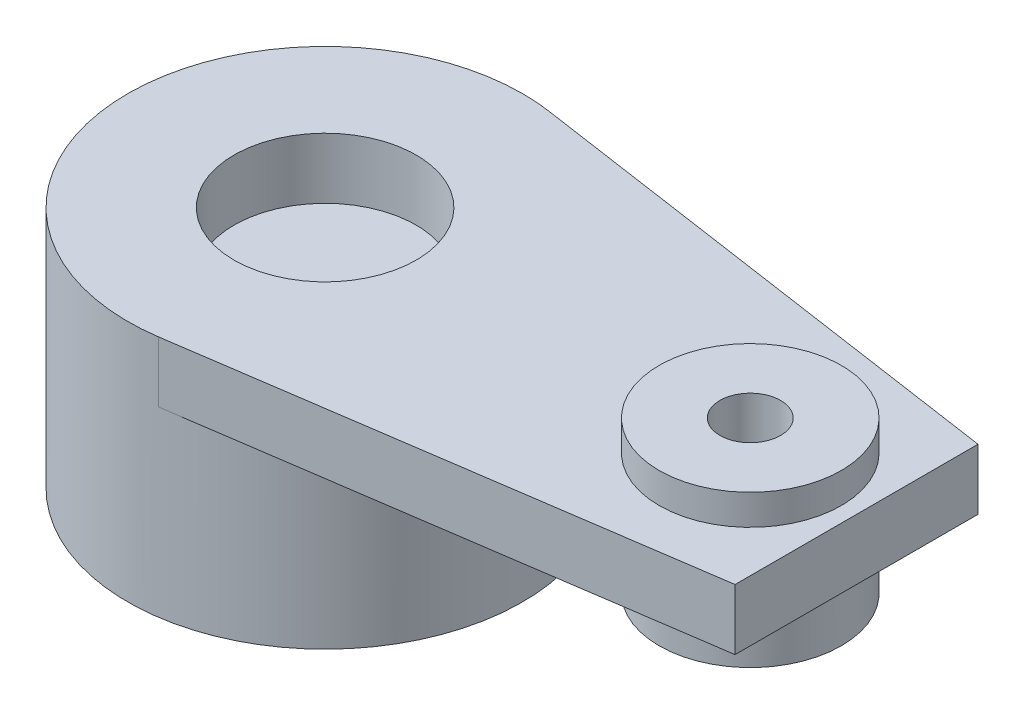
ISO-10303-21;
HEADER;
FILE_DESCRIPTION(('STEP AP214'),'2;1');
FILE_NAME('part.step','',(''),(''),'','','');
FILE_SCHEMA(('AUTOMOTIVE_DESIGN { 1 0 10303 214 1 1 1 1 }'));
ENDSEC;
DATA;
#1=APPLICATION_CONTEXT('core data for automotive mechanical design processes');
#2=APPLICATION_PROTOCOL_DEFINITION('international standard','automotive_design',2000,#1);
#3=PRODUCT_CONTEXT('',#1,'mechanical');
#4=PRODUCT('Part','Part','',(#3));
#5=PRODUCT_RELATED_PRODUCT_CATEGORY('part','',(#4));
#6=PRODUCT_DEFINITION_FORMATION('','',#4);
#7=PRODUCT_DEFINITION_CONTEXT('part definition',#1,'design');
#8=PRODUCT_DEFINITION('design','',#6,#7);
#9=PRODUCT_DEFINITION_SHAPE('','',#8);
#10=(LENGTH_UNIT() NAMED_UNIT(*) SI_UNIT(.MILLI.,.METRE.));
#11=(NAMED_UNIT(*) PLANE_ANGLE_UNIT() SI_UNIT($,.RADIAN.));
#12=(NAMED_UNIT(*) SI_UNIT($,.STERADIAN.) SOLID_ANGLE_UNIT());
#13=UNCERTAINTY_MEASURE_WITH_UNIT(LENGTH_MEASURE(1.E-05),#10,'distance_accuracy_value','');
#14=(GEOMETRIC_REPRESENTATION_CONTEXT(3) GLOBAL_UNCERTAINTY_ASSIGNED_CONTEXT((#13)) GLOBAL_UNIT_ASSIGNED_CONTEXT((#10,
#11,#12)) REPRESENTATION_CONTEXT('',''));
#15=CARTESIAN_POINT('',(0.,0.,0.));
#16=DIRECTION('',(0.,0.,1.));
#17=DIRECTION('',(1.,0.,0.));
#18=AXIS2_PLACEMENT_3D('',#15,#16,#17);
#19=CARTESIAN_POINT('',(0.,2.54,0.));
#20=DIRECTION('',(0.,1.,0.));
#21=DIRECTION('',(0.,0.,1.));
#22=AXIS2_PLACEMENT_3D('',#19,#20,#21);
#23=PLANE('',#22);
#24=DIRECTION('',(-0.989390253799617,0.,0.145282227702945));
#25=VECTOR('',#24,1.);
#26=CARTESIAN_POINT('',(1.19930478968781,2.54,8.16741654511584));
#27=LINE('',#26,#25);
#28=CARTESIAN_POINT('',(22.225,2.54,5.08));
#29=VERTEX_POINT('',#28);
#30=CARTESIAN_POINT('',(1.19930478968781,2.54,8.16741654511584));
#31=VERTEX_POINT('',#30);
#32=EDGE_CURVE('E108',#29,#31,#27,.T.);
#33=ORIENTED_EDGE('',*,*,#32,.F.);
#34=DIRECTION('',(0.,0.,1.));
#35=VECTOR('',#34,1.);
#36=CARTESIAN_POINT('',(22.225,2.54,0.));
#37=LINE('',#36,#35);
#38=CARTESIAN_POINT('',(22.225,2.54,-5.08));
#39=VERTEX_POINT('',#38);
#40=EDGE_CURVE('E125',#39,#29,#37,.T.);
#41=ORIENTED_EDGE('',*,*,#40,.F.);
#42=DIRECTION('',(-0.989390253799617,0.,-0.145282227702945));
#43=VECTOR('',#42,1.);
#44=CARTESIAN_POINT('',(1.19930478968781,2.54,-8.16741654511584));
#45=LINE('',#44,#43);
#46=CARTESIAN_POINT('',(1.19930478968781,2.54,-8.16741654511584));
#47=VERTEX_POINT('',#46);
#48=EDGE_CURVE('E134',#39,#47,#45,.T.);
#49=ORIENTED_EDGE('',*,*,#48,.T.);
#50=CARTESIAN_POINT('',(0.,2.54,0.));
#51=DIRECTION('',(0.,1.,0.));
#52=DIRECTION('',(0.,0.,1.));
#53=AXIS2_PLACEMENT_3D('',#50,#51,#52);
#54=CIRCLE('',#53,8.255);
#55=EDGE_CURVE('E62',#47,#31,#54,.T.);
#56=ORIENTED_EDGE('',*,*,#55,.T.);
#57=EDGE_LOOP('',(#33,#41,#49,#56));
#58=FACE_BOUND('',#57,.T.);
#59=CARTESIAN_POINT('',(0.,2.54,0.));
#60=DIRECTION('',(0.,1.,0.));
#61=DIRECTION('',(0.,0.,1.));
#62=AXIS2_PLACEMENT_3D('',#59,#60,#61);
#63=CIRCLE('',#62,3.81);
#64=CARTESIAN_POINT('',(0.,2.54,3.81));
#65=VERTEX_POINT('',#64);
#66=EDGE_CURVE('E141',#65,#65,#63,.T.);
#67=ORIENTED_EDGE('',*,*,#66,.F.);
#68=EDGE_LOOP('',(#67));
#69=FACE_BOUND('',#68,.T.);
#70=CARTESIAN_POINT('',(17.78,2.54,0.));
#71=DIRECTION('',(0.,1.,0.));
#72=DIRECTION('',(0.,0.,1.));
#73=AXIS2_PLACEMENT_3D('',#70,#71,#72);
#74=CIRCLE('',#73,3.81);
#75=CARTESIAN_POINT('',(17.78,2.54,3.81));
#76=VERTEX_POINT('',#75);
#77=EDGE_CURVE('E159',#76,#76,#74,.T.);
#78=ORIENTED_EDGE('',*,*,#77,.F.);
#79=EDGE_LOOP('',(#78));
#80=FACE_BOUND('',#79,.T.);
#81=ADVANCED_FACE('F44',(#58,#69,#80),#23,.T.);
#82=CARTESIAN_POINT('',(0.,0.,0.));
#83=DIRECTION('',(0.,1.,0.));
#84=DIRECTION('',(0.,0.,1.));
#85=AXIS2_PLACEMENT_3D('',#82,#83,#84);
#86=PLANE('',#85);
#87=CARTESIAN_POINT('',(0.,0.,0.));
#88=DIRECTION('',(0.,-1.,0.));
#89=DIRECTION('',(0.,0.,-1.));
#90=AXIS2_PLACEMENT_3D('',#87,#88,#89);
#91=CIRCLE('',#90,8.255);
#92=CARTESIAN_POINT('',(1.19930478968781,0.,-8.16741654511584));
#93=VERTEX_POINT('',#92);
#94=CARTESIAN_POINT('',(1.19930478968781,0.,8.16741654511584));
#95=VERTEX_POINT('',#94);
#96=EDGE_CURVE('E84',#93,#95,#91,.T.);
#97=ORIENTED_EDGE('',*,*,#96,.F.);
#98=DIRECTION('',(-0.989390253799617,0.,-0.145282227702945));
#99=VECTOR('',#98,1.);
#100=CARTESIAN_POINT('',(1.19930478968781,0.,-8.16741654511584));
#101=LINE('',#100,#99);
#102=CARTESIAN_POINT('',(22.225,0.,-5.08));
#103=VERTEX_POINT('',#102);
#104=EDGE_CURVE('E97',#103,#93,#101,.T.);
#105=ORIENTED_EDGE('',*,*,#104,.F.);
#106=DIRECTION('',(0.,0.,1.));
#107=VECTOR('',#106,1.);
#108=CARTESIAN_POINT('',(22.225,0.,0.));
#109=LINE('',#108,#107);
#110=CARTESIAN_POINT('',(22.225,0.,5.08));
#111=VERTEX_POINT('',#110);
#112=EDGE_CURVE('E109',#103,#111,#109,.T.);
#113=ORIENTED_EDGE('',*,*,#112,.T.);
#114=DIRECTION('',(-0.989390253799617,0.,0.145282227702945));
#115=VECTOR('',#114,1.);
#116=CARTESIAN_POINT('',(1.19930478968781,0.,8.16741654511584));
#117=LINE('',#116,#115);
#118=EDGE_CURVE('E99',#111,#95,#117,.T.);
#119=ORIENTED_EDGE('',*,*,#118,.T.);
#120=EDGE_LOOP('',(#97,#105,#113,#119));
#121=FACE_BOUND('',#120,.T.);
#122=CARTESIAN_POINT('',(17.78,0.,0.));
#123=DIRECTION('',(0.,1.,0.));
#124=DIRECTION('',(0.,0.,1.));
#125=AXIS2_PLACEMENT_3D('',#122,#123,#124);
#126=CIRCLE('',#125,3.81);
#127=CARTESIAN_POINT('',(17.78,0.,3.81));
#128=VERTEX_POINT('',#127);
#129=EDGE_CURVE('E11',#128,#128,#126,.F.);
#130=ORIENTED_EDGE('',*,*,#129,.F.);
#131=EDGE_LOOP('',(#130));
#132=FACE_BOUND('',#131,.T.);
#133=ADVANCED_FACE('F94',(#121,#132),#86,.F.);
#134=CARTESIAN_POINT('',(1.19930478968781,2.54,8.16741654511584));
#135=DIRECTION('',(0.145282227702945,0.,0.989390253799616));
#136=DIRECTION('',(0.989390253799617,0.,-0.145282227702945));
#137=AXIS2_PLACEMENT_3D('',#134,#135,#136);
#138=PLANE('',#137);
#139=ORIENTED_EDGE('',*,*,#118,.F.);
#140=DIRECTION('',(0.,-1.,0.));
#141=VECTOR('',#140,1.);
#142=CARTESIAN_POINT('',(22.225,2.54,5.08));
#143=LINE('',#142,#141);
#144=EDGE_CURVE('E54',#29,#111,#143,.T.);
#145=ORIENTED_EDGE('',*,*,#144,.F.);
#146=ORIENTED_EDGE('',*,*,#32,.T.);
#147=DIRECTION('',(0.,-1.,0.));
#148=VECTOR('',#147,1.);
#149=CARTESIAN_POINT('',(1.19930478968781,2.54,8.16741654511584));
#150=LINE('',#149,#148);
#151=EDGE_CURVE('E114',#31,#95,#150,.T.);
#152=ORIENTED_EDGE('',*,*,#151,.T.);
#153=EDGE_LOOP('',(#139,#145,#146,#152));
#154=FACE_BOUND('',#153,.T.);
#155=ADVANCED_FACE('F46',(#154),#138,.T.);
#156=CARTESIAN_POINT('',(22.225,2.54,0.));
#157=DIRECTION('',(1.,0.,0.));
#158=DIRECTION('',(0.,0.,-1.));
#159=AXIS2_PLACEMENT_3D('',#156,#157,#158);
#160=PLANE('',#159);
#161=ORIENTED_EDGE('',*,*,#112,.F.);
#162=DIRECTION('',(0.,-1.,0.));
#163=VECTOR('',#162,1.);
#164=CARTESIAN_POINT('',(22.225,2.54,-5.08));
#165=LINE('',#164,#163);
#166=EDGE_CURVE('E77',#39,#103,#165,.T.);
#167=ORIENTED_EDGE('',*,*,#166,.F.);
#168=ORIENTED_EDGE('',*,*,#40,.T.);
#169=ORIENTED_EDGE('',*,*,#144,.T.);
#170=EDGE_LOOP('',(#161,#167,#168,#169));
#171=FACE_BOUND('',#170,.T.);
#172=ADVANCED_FACE('F123',(#171),#160,.T.);
#173=CARTESIAN_POINT('',(1.19930478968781,2.54,-8.16741654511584));
#174=DIRECTION('',(-0.145282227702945,0.,0.989390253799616));
#175=DIRECTION('',(0.989390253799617,0.,0.145282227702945));
#176=AXIS2_PLACEMENT_3D('',#173,#174,#175);
#177=PLANE('',#176);
#178=ORIENTED_EDGE('',*,*,#104,.T.);
#179=DIRECTION('',(0.,-1.,0.));
#180=VECTOR('',#179,1.);
#181=CARTESIAN_POINT('',(1.19930478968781,2.54,-8.16741654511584));
#182=LINE('',#181,#180);
#183=EDGE_CURVE('E106',#47,#93,#182,.T.);
#184=ORIENTED_EDGE('',*,*,#183,.F.);
#185=ORIENTED_EDGE('',*,*,#48,.F.);
#186=ORIENTED_EDGE('',*,*,#166,.T.);
#187=EDGE_LOOP('',(#178,#184,#185,#186));
#188=FACE_BOUND('',#187,.T.);
#189=ADVANCED_FACE('F105',(#188),#177,.F.);
#190=CARTESIAN_POINT('',(0.,2.54,0.));
#191=DIRECTION('',(0.,-1.,0.));
#192=DIRECTION('',(0.,0.,-1.));
#193=AXIS2_PLACEMENT_3D('',#190,#191,#192);
#194=CYLINDRICAL_SURFACE('',#193,8.255);
#195=ORIENTED_EDGE('',*,*,#183,.T.);
#196=ORIENTED_EDGE('',*,*,#96,.T.);
#197=ORIENTED_EDGE('',*,*,#151,.F.);
#198=ORIENTED_EDGE('',*,*,#55,.F.);
#199=EDGE_LOOP('',(#195,#196,#197,#198));
#200=FACE_BOUND('',#199,.T.);
#201=CARTESIAN_POINT('',(0.,-7.62,0.));
#202=DIRECTION('',(0.,-1.,0.));
#203=DIRECTION('',(0.,0.,-1.));
#204=AXIS2_PLACEMENT_3D('',#201,#202,#203);
#205=CIRCLE('',#204,8.255);
#206=CARTESIAN_POINT('',(0.,-7.62,-8.255));
#207=VERTEX_POINT('',#206);
#208=EDGE_CURVE('E101',#207,#207,#205,.T.);
#209=ORIENTED_EDGE('',*,*,#208,.F.);
#210=EDGE_LOOP('',(#209));
#211=FACE_BOUND('',#210,.T.);
#212=ADVANCED_FACE('F111',(#200,#211),#194,.T.);
#213=CARTESIAN_POINT('',(17.78,0.,0.));
#214=DIRECTION('',(0.,1.,0.));
#215=DIRECTION('',(0.,0.,1.));
#216=AXIS2_PLACEMENT_3D('',#213,#214,#215);
#217=CYLINDRICAL_SURFACE('',#216,1.27);
#218=CARTESIAN_POINT('',(17.78,-2.54,0.));
#219=DIRECTION('',(0.,-1.,0.));
#220=DIRECTION('',(0.,0.,-1.));
#221=AXIS2_PLACEMENT_3D('',#218,#219,#220);
#222=CIRCLE('',#221,1.27);
#223=CARTESIAN_POINT('',(17.78,-2.54,-1.27));
#224=VERTEX_POINT('',#223);
#225=EDGE_CURVE('E154',#224,#224,#222,.T.);
#226=ORIENTED_EDGE('',*,*,#225,.T.);
#227=EDGE_LOOP('',(#226));
#228=FACE_BOUND('',#227,.T.);
#229=CARTESIAN_POINT('',(17.78,3.81,0.));
#230=DIRECTION('',(0.,1.,0.));
#231=DIRECTION('',(0.,0.,1.));
#232=AXIS2_PLACEMENT_3D('',#229,#230,#231);
#233=CIRCLE('',#232,1.27);
#234=CARTESIAN_POINT('',(17.78,3.81,1.27));
#235=VERTEX_POINT('',#234);
#236=EDGE_CURVE('E163',#235,#235,#233,.T.);
#237=ORIENTED_EDGE('',*,*,#236,.T.);
#238=EDGE_LOOP('',(#237));
#239=FACE_BOUND('',#238,.T.);
#240=ADVANCED_FACE('F196',(#228,#239),#217,.F.);
#241=CARTESIAN_POINT('',(0.,0.,0.));
#242=DIRECTION('',(0.,1.,0.));
#243=DIRECTION('',(0.,0.,1.));
#244=AXIS2_PLACEMENT_3D('',#241,#242,#243);
#245=CYLINDRICAL_SURFACE('',#244,3.81);
#246=CARTESIAN_POINT('',(0.,0.,0.));
#247=DIRECTION('',(0.,1.,0.));
#248=DIRECTION('',(0.,0.,1.));
#249=AXIS2_PLACEMENT_3D('',#246,#247,#248);
#250=CIRCLE('',#249,3.81);
#251=CARTESIAN_POINT('',(0.,0.,3.81));
#252=VERTEX_POINT('',#251);
#253=EDGE_CURVE('E127',#252,#252,#250,.T.);
#254=ORIENTED_EDGE('',*,*,#253,.F.);
#255=EDGE_LOOP('',(#254));
#256=FACE_BOUND('',#255,.T.);
#257=ORIENTED_EDGE('',*,*,#66,.T.);
#258=EDGE_LOOP('',(#257));
#259=FACE_BOUND('',#258,.T.);
#260=ADVANCED_FACE('F192',(#256,#259),#245,.F.);
#261=CARTESIAN_POINT('',(0.,-7.62,0.));
#262=DIRECTION('',(0.,-1.,0.));
#263=DIRECTION('',(0.,0.,-1.));
#264=AXIS2_PLACEMENT_3D('',#261,#262,#263);
#265=PLANE('',#264);
#266=CARTESIAN_POINT('',(0.,-7.62,0.));
#267=DIRECTION('',(0.,-1.,0.));
#268=DIRECTION('',(0.,0.,-1.));
#269=AXIS2_PLACEMENT_3D('',#266,#267,#268);
#270=CIRCLE('',#269,2.54);
#271=CARTESIAN_POINT('',(0.,-7.62,-2.54));
#272=VERTEX_POINT('',#271);
#273=EDGE_CURVE('E171',#272,#272,#270,.T.);
#274=ORIENTED_EDGE('',*,*,#273,.F.);
#275=EDGE_LOOP('',(#274));
#276=FACE_BOUND('',#275,.T.);
#277=ORIENTED_EDGE('',*,*,#208,.T.);
#278=EDGE_LOOP('',(#277));
#279=FACE_BOUND('',#278,.T.);
#280=ADVANCED_FACE('F188',(#276,#279),#265,.T.);
#281=CARTESIAN_POINT('',(0.,0.,0.));
#282=DIRECTION('',(0.,-1.,0.));
#283=DIRECTION('',(0.,0.,-1.));
#284=AXIS2_PLACEMENT_3D('',#281,#282,#283);
#285=PLANE('',#284);
#286=ORIENTED_EDGE('',*,*,#253,.T.);
#287=EDGE_LOOP('',(#286));
#288=FACE_BOUND('',#287,.T.);
#289=ADVANCED_FACE('F191',(#288),#285,.F.);
#290=CARTESIAN_POINT('',(17.78,-2.54,0.));
#291=DIRECTION('',(0.,-1.,0.));
#292=DIRECTION('',(0.,0.,-1.));
#293=AXIS2_PLACEMENT_3D('',#290,#291,#292);
#294=PLANE('',#293);
#295=CARTESIAN_POINT('',(17.78,-2.54,0.));
#296=DIRECTION('',(0.,-1.,0.));
#297=DIRECTION('',(0.,0.,-1.));
#298=AXIS2_PLACEMENT_3D('',#295,#296,#297);
#299=CIRCLE('',#298,3.81);
#300=CARTESIAN_POINT('',(17.78,-2.54,-3.81));
#301=VERTEX_POINT('',#300);
#302=EDGE_CURVE('E102',#301,#301,#299,.T.);
#303=ORIENTED_EDGE('',*,*,#302,.T.);
#304=EDGE_LOOP('',(#303));
#305=FACE_BOUND('',#304,.T.);
#306=ORIENTED_EDGE('',*,*,#225,.F.);
#307=EDGE_LOOP('',(#306));
#308=FACE_BOUND('',#307,.T.);
#309=ADVANCED_FACE('F217',(#305,#308),#294,.T.);
#310=CARTESIAN_POINT('',(17.78,-2.54,0.));
#311=DIRECTION('',(0.,1.,0.));
#312=DIRECTION('',(0.,0.,1.));
#313=AXIS2_PLACEMENT_3D('',#310,#311,#312);
#314=CYLINDRICAL_SURFACE('',#313,3.81);
#315=ORIENTED_EDGE('',*,*,#302,.F.);
#316=EDGE_LOOP('',(#315));
#317=FACE_BOUND('',#316,.T.);
#318=ORIENTED_EDGE('',*,*,#129,.T.);
#319=EDGE_LOOP('',(#318));
#320=FACE_BOUND('',#319,.T.);
#321=ADVANCED_FACE('F220',(#317,#320),#314,.T.);
#322=CARTESIAN_POINT('',(17.78,3.81,0.));
#323=DIRECTION('',(0.,1.,0.));
#324=DIRECTION('',(0.,0.,1.));
#325=AXIS2_PLACEMENT_3D('',#322,#323,#324);
#326=PLANE('',#325);
#327=CARTESIAN_POINT('',(17.78,3.81,0.));
#328=DIRECTION('',(0.,1.,0.));
#329=DIRECTION('',(0.,0.,1.));
#330=AXIS2_PLACEMENT_3D('',#327,#328,#329);
#331=CIRCLE('',#330,3.81);
#332=CARTESIAN_POINT('',(17.78,3.81,3.81));
#333=VERTEX_POINT('',#332);
#334=EDGE_CURVE('E158',#333,#333,#331,.T.);
#335=ORIENTED_EDGE('',*,*,#334,.T.);
#336=EDGE_LOOP('',(#335));
#337=FACE_BOUND('',#336,.T.);
#338=ORIENTED_EDGE('',*,*,#236,.F.);
#339=EDGE_LOOP('',(#338));
#340=FACE_BOUND('',#339,.T.);
#341=ADVANCED_FACE('F223',(#337,#340),#326,.T.);
#342=CARTESIAN_POINT('',(17.78,3.81,0.));
#343=DIRECTION('',(0.,-1.,0.));
#344=DIRECTION('',(0.,0.,-1.));
#345=AXIS2_PLACEMENT_3D('',#342,#343,#344);
#346=CYLINDRICAL_SURFACE('',#345,3.81);
#347=ORIENTED_EDGE('',*,*,#334,.F.);
#348=EDGE_LOOP('',(#347));
#349=FACE_BOUND('',#348,.T.);
#350=ORIENTED_EDGE('',*,*,#77,.T.);
#351=EDGE_LOOP('',(#350));
#352=FACE_BOUND('',#351,.T.);
#353=ADVANCED_FACE('F184',(#349,#352),#346,.T.);
#354=CARTESIAN_POINT('',(0.,-5.08,0.));
#355=DIRECTION('',(0.,-1.,0.));
#356=DIRECTION('',(0.,0.,-1.));
#357=AXIS2_PLACEMENT_3D('',#354,#355,#356);
#358=CYLINDRICAL_SURFACE('',#357,2.54);
#359=CARTESIAN_POINT('',(0.,-5.08,0.));
#360=DIRECTION('',(0.,-1.,0.));
#361=DIRECTION('',(0.,0.,-1.));
#362=AXIS2_PLACEMENT_3D('',#359,#360,#361);
#363=CIRCLE('',#362,2.54);
#364=CARTESIAN_POINT('',(0.,-5.08,-2.54));
#365=VERTEX_POINT('',#364);
#366=EDGE_CURVE('E170',#365,#365,#363,.T.);
#367=ORIENTED_EDGE('',*,*,#366,.F.);
#368=EDGE_LOOP('',(#367));
#369=FACE_BOUND('',#368,.T.);
#370=ORIENTED_EDGE('',*,*,#273,.T.);
#371=EDGE_LOOP('',(#370));
#372=FACE_BOUND('',#371,.T.);
#373=ADVANCED_FACE('F181',(#369,#372),#358,.F.);
#374=CARTESIAN_POINT('',(0.,-5.08,0.));
#375=DIRECTION('',(0.,-1.,0.));
#376=DIRECTION('',(0.,0.,-1.));
#377=AXIS2_PLACEMENT_3D('',#374,#375,#376);
#378=PLANE('',#377);
#379=ORIENTED_EDGE('',*,*,#366,.T.);
#380=EDGE_LOOP('',(#379));
#381=FACE_BOUND('',#380,.T.);
#382=ADVANCED_FACE('F179',(#381),#378,.T.);
#383=CLOSED_SHELL('',(#81,#133,#155,#172,#189,#212,#240,#260,#280,#289,#309,#321,#341,#353,#373,#382));
#384=MANIFOLD_SOLID_BREP('B2',#383);
#385=ADVANCED_BREP_SHAPE_REPRESENTATION('',(#18,#384),#14);
#386=SHAPE_DEFINITION_REPRESENTATION(#9,#385);
ENDSEC;
END-ISO-10303-21;
